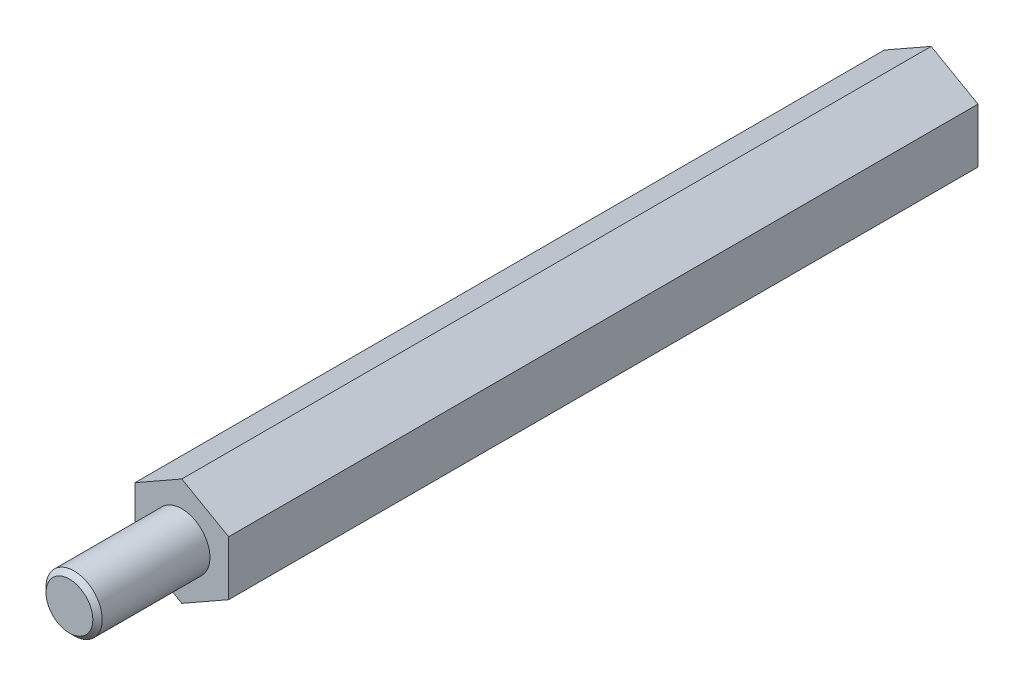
ISO-10303-21;
HEADER;
FILE_DESCRIPTION(('STEP AP214'),'2;1');
FILE_NAME('part.step','',(''),(''),'','','');
FILE_SCHEMA(('AUTOMOTIVE_DESIGN { 1 0 10303 214 1 1 1 1 }'));
ENDSEC;
DATA;
#1=APPLICATION_CONTEXT('core data for automotive mechanical design processes');
#2=APPLICATION_PROTOCOL_DEFINITION('international standard','automotive_design',2000,#1);
#3=PRODUCT_CONTEXT('',#1,'mechanical');
#4=PRODUCT('Part','Part','',(#3));
#5=PRODUCT_RELATED_PRODUCT_CATEGORY('part','',(#4));
#6=PRODUCT_DEFINITION_FORMATION('','',#4);
#7=PRODUCT_DEFINITION_CONTEXT('part definition',#1,'design');
#8=PRODUCT_DEFINITION('design','',#6,#7);
#9=PRODUCT_DEFINITION_SHAPE('','',#8);
#10=(LENGTH_UNIT() NAMED_UNIT(*) SI_UNIT(.MILLI.,.METRE.));
#11=(NAMED_UNIT(*) PLANE_ANGLE_UNIT() SI_UNIT($,.RADIAN.));
#12=(NAMED_UNIT(*) SI_UNIT($,.STERADIAN.) SOLID_ANGLE_UNIT());
#13=UNCERTAINTY_MEASURE_WITH_UNIT(LENGTH_MEASURE(1.E-05),#10,'distance_accuracy_value','');
#14=(GEOMETRIC_REPRESENTATION_CONTEXT(3) GLOBAL_UNCERTAINTY_ASSIGNED_CONTEXT((#13)) GLOBAL_UNIT_ASSIGNED_CONTEXT((#10,
#11,#12)) REPRESENTATION_CONTEXT('',''));
#15=CARTESIAN_POINT('',(0.,0.,0.));
#16=DIRECTION('',(0.,0.,1.));
#17=DIRECTION('',(1.,0.,0.));
#18=AXIS2_PLACEMENT_3D('',#15,#16,#17);
#19=CARTESIAN_POINT('',(-5.,8.58945417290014,80.));
#20=DIRECTION('',(0.,0.,-1.));
#21=DIRECTION('',(-1.,0.,0.));
#22=AXIS2_PLACEMENT_3D('',#19,#20,#21);
#23=PLANE('',#22);
#24=DIRECTION('',(-0.869565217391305,0.493818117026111,0.));
#25=VECTOR('',#24,1.);
#26=CARTESIAN_POINT('',(5.,2.91054582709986,80.));
#27=LINE('',#26,#25);
#28=CARTESIAN_POINT('',(5.,2.91054582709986,80.));
#29=VERTEX_POINT('',#28);
#30=CARTESIAN_POINT('',(0.,5.75,80.));
#31=VERTEX_POINT('',#30);
#32=EDGE_CURVE('E117',#29,#31,#27,.T.);
#33=ORIENTED_EDGE('',*,*,#32,.T.);
#34=DIRECTION('',(-0.869565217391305,-0.493818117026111,0.));
#35=VECTOR('',#34,1.);
#36=CARTESIAN_POINT('',(-5.,2.91054582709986,80.));
#37=LINE('',#36,#35);
#38=CARTESIAN_POINT('',(-5.,2.91054582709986,80.));
#39=VERTEX_POINT('',#38);
#40=EDGE_CURVE('E119',#31,#39,#37,.T.);
#41=ORIENTED_EDGE('',*,*,#40,.T.);
#42=DIRECTION('',(0.,-1.,0.));
#43=VECTOR('',#42,1.);
#44=CARTESIAN_POINT('',(-5.,-2.91054582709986,80.));
#45=LINE('',#44,#43);
#46=CARTESIAN_POINT('',(-5.,-2.91054582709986,80.));
#47=VERTEX_POINT('',#46);
#48=EDGE_CURVE('E121',#39,#47,#45,.T.);
#49=ORIENTED_EDGE('',*,*,#48,.T.);
#50=DIRECTION('',(0.869565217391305,-0.493818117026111,0.));
#51=VECTOR('',#50,1.);
#52=CARTESIAN_POINT('',(-5.,-2.91054582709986,80.));
#53=LINE('',#52,#51);
#54=CARTESIAN_POINT('',(0.,-5.75,80.));
#55=VERTEX_POINT('',#54);
#56=EDGE_CURVE('E123',#47,#55,#53,.T.);
#57=ORIENTED_EDGE('',*,*,#56,.T.);
#58=DIRECTION('',(0.869565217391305,0.493818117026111,0.));
#59=VECTOR('',#58,1.);
#60=CARTESIAN_POINT('',(5.,-2.91054582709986,80.));
#61=LINE('',#60,#59);
#62=CARTESIAN_POINT('',(5.,-2.91054582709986,80.));
#63=VERTEX_POINT('',#62);
#64=EDGE_CURVE('E52',#55,#63,#61,.T.);
#65=ORIENTED_EDGE('',*,*,#64,.T.);
#66=DIRECTION('',(0.,1.,0.));
#67=VECTOR('',#66,1.);
#68=CARTESIAN_POINT('',(5.,-2.91054582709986,80.));
#69=LINE('',#68,#67);
#70=EDGE_CURVE('E47',#63,#29,#69,.T.);
#71=ORIENTED_EDGE('',*,*,#70,.T.);
#72=EDGE_LOOP('',(#33,#41,#49,#57,#65,#71));
#73=FACE_BOUND('',#72,.T.);
#74=CARTESIAN_POINT('',(0.,0.,80.));
#75=DIRECTION('',(0.,0.,-1.));
#76=DIRECTION('',(-1.,0.,0.));
#77=AXIS2_PLACEMENT_3D('',#74,#75,#76);
#78=CIRCLE('',#77,3.);
#79=CARTESIAN_POINT('',(-3.,0.,80.));
#80=VERTEX_POINT('',#79);
#81=EDGE_CURVE('E145',#80,#80,#78,.F.);
#82=ORIENTED_EDGE('',*,*,#81,.F.);
#83=EDGE_LOOP('',(#82));
#84=FACE_BOUND('',#83,.T.);
#85=ADVANCED_FACE('F32',(#73,#84),#23,.F.);
#86=CARTESIAN_POINT('',(5.,2.91054582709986,80.));
#87=DIRECTION('',(-0.493818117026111,-0.869565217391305,0.));
#88=DIRECTION('',(0.869565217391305,-0.493818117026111,0.));
#89=AXIS2_PLACEMENT_3D('',#86,#87,#88);
#90=PLANE('',#89);
#91=DIRECTION('',(-0.869565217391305,0.493818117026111,0.));
#92=VECTOR('',#91,1.);
#93=CARTESIAN_POINT('',(5.,2.91054582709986,0.));
#94=LINE('',#93,#92);
#95=CARTESIAN_POINT('',(5.,2.91054582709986,0.));
#96=VERTEX_POINT('',#95);
#97=CARTESIAN_POINT('',(0.,5.75,0.));
#98=VERTEX_POINT('',#97);
#99=EDGE_CURVE('E104',#96,#98,#94,.T.);
#100=ORIENTED_EDGE('',*,*,#99,.T.);
#101=DIRECTION('',(0.,0.,-1.));
#102=VECTOR('',#101,1.);
#103=CARTESIAN_POINT('',(0.,5.75,80.));
#104=LINE('',#103,#102);
#105=EDGE_CURVE('E142',#31,#98,#104,.T.);
#106=ORIENTED_EDGE('',*,*,#105,.F.);
#107=ORIENTED_EDGE('',*,*,#32,.F.);
#108=DIRECTION('',(0.,0.,-1.));
#109=VECTOR('',#108,1.);
#110=CARTESIAN_POINT('',(5.,2.91054582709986,80.));
#111=LINE('',#110,#109);
#112=EDGE_CURVE('E127',#29,#96,#111,.T.);
#113=ORIENTED_EDGE('',*,*,#112,.T.);
#114=EDGE_LOOP('',(#100,#106,#107,#113));
#115=FACE_BOUND('',#114,.T.);
#116=ADVANCED_FACE('F34',(#115),#90,.F.);
#117=CARTESIAN_POINT('',(-5.,2.91054582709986,80.));
#118=DIRECTION('',(0.493818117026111,-0.869565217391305,0.));
#119=DIRECTION('',(0.869565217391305,0.493818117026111,0.));
#120=AXIS2_PLACEMENT_3D('',#117,#118,#119);
#121=PLANE('',#120);
#122=DIRECTION('',(-0.869565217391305,-0.493818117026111,0.));
#123=VECTOR('',#122,1.);
#124=CARTESIAN_POINT('',(-5.,2.91054582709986,0.));
#125=LINE('',#124,#123);
#126=CARTESIAN_POINT('',(-5.,2.91054582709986,0.));
#127=VERTEX_POINT('',#126);
#128=EDGE_CURVE('E107',#98,#127,#125,.T.);
#129=ORIENTED_EDGE('',*,*,#128,.T.);
#130=DIRECTION('',(0.,0.,-1.));
#131=VECTOR('',#130,1.);
#132=CARTESIAN_POINT('',(-5.,2.91054582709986,80.));
#133=LINE('',#132,#131);
#134=EDGE_CURVE('E139',#39,#127,#133,.T.);
#135=ORIENTED_EDGE('',*,*,#134,.F.);
#136=ORIENTED_EDGE('',*,*,#40,.F.);
#137=ORIENTED_EDGE('',*,*,#105,.T.);
#138=EDGE_LOOP('',(#129,#135,#136,#137));
#139=FACE_BOUND('',#138,.T.);
#140=ADVANCED_FACE('F166',(#139),#121,.F.);
#141=CARTESIAN_POINT('',(-5.,-2.91054582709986,80.));
#142=DIRECTION('',(1.,0.,0.));
#143=DIRECTION('',(0.,0.,-1.));
#144=AXIS2_PLACEMENT_3D('',#141,#142,#143);
#145=PLANE('',#144);
#146=DIRECTION('',(0.,-1.,0.));
#147=VECTOR('',#146,1.);
#148=CARTESIAN_POINT('',(-5.,-2.91054582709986,0.));
#149=LINE('',#148,#147);
#150=CARTESIAN_POINT('',(-5.,-2.91054582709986,0.));
#151=VERTEX_POINT('',#150);
#152=EDGE_CURVE('E109',#127,#151,#149,.T.);
#153=ORIENTED_EDGE('',*,*,#152,.T.);
#154=DIRECTION('',(0.,0.,-1.));
#155=VECTOR('',#154,1.);
#156=CARTESIAN_POINT('',(-5.,-2.91054582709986,80.));
#157=LINE('',#156,#155);
#158=EDGE_CURVE('E136',#47,#151,#157,.T.);
#159=ORIENTED_EDGE('',*,*,#158,.F.);
#160=ORIENTED_EDGE('',*,*,#48,.F.);
#161=ORIENTED_EDGE('',*,*,#134,.T.);
#162=EDGE_LOOP('',(#153,#159,#160,#161));
#163=FACE_BOUND('',#162,.T.);
#164=ADVANCED_FACE('F184',(#163),#145,.F.);
#165=CARTESIAN_POINT('',(-5.,-2.91054582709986,80.));
#166=DIRECTION('',(0.493818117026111,0.869565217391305,0.));
#167=DIRECTION('',(-0.869565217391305,0.493818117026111,0.));
#168=AXIS2_PLACEMENT_3D('',#165,#166,#167);
#169=PLANE('',#168);
#170=DIRECTION('',(0.869565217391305,-0.493818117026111,0.));
#171=VECTOR('',#170,1.);
#172=CARTESIAN_POINT('',(-5.,-2.91054582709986,0.));
#173=LINE('',#172,#171);
#174=CARTESIAN_POINT('',(0.,-5.75,0.));
#175=VERTEX_POINT('',#174);
#176=EDGE_CURVE('E111',#151,#175,#173,.T.);
#177=ORIENTED_EDGE('',*,*,#176,.T.);
#178=DIRECTION('',(0.,0.,-1.));
#179=VECTOR('',#178,1.);
#180=CARTESIAN_POINT('',(0.,-5.75,80.));
#181=LINE('',#180,#179);
#182=EDGE_CURVE('E133',#55,#175,#181,.T.);
#183=ORIENTED_EDGE('',*,*,#182,.F.);
#184=ORIENTED_EDGE('',*,*,#56,.F.);
#185=ORIENTED_EDGE('',*,*,#158,.T.);
#186=EDGE_LOOP('',(#177,#183,#184,#185));
#187=FACE_BOUND('',#186,.T.);
#188=ADVANCED_FACE('F180',(#187),#169,.F.);
#189=CARTESIAN_POINT('',(5.,-2.91054582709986,80.));
#190=DIRECTION('',(-0.493818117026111,0.869565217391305,0.));
#191=DIRECTION('',(-0.869565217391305,-0.493818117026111,0.));
#192=AXIS2_PLACEMENT_3D('',#189,#190,#191);
#193=PLANE('',#192);
#194=DIRECTION('',(0.869565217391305,0.493818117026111,0.));
#195=VECTOR('',#194,1.);
#196=CARTESIAN_POINT('',(5.,-2.91054582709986,0.));
#197=LINE('',#196,#195);
#198=CARTESIAN_POINT('',(5.,-2.91054582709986,0.));
#199=VERTEX_POINT('',#198);
#200=EDGE_CURVE('E113',#175,#199,#197,.T.);
#201=ORIENTED_EDGE('',*,*,#200,.T.);
#202=DIRECTION('',(0.,0.,-1.));
#203=VECTOR('',#202,1.);
#204=CARTESIAN_POINT('',(5.,-2.91054582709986,80.));
#205=LINE('',#204,#203);
#206=EDGE_CURVE('E130',#63,#199,#205,.T.);
#207=ORIENTED_EDGE('',*,*,#206,.F.);
#208=ORIENTED_EDGE('',*,*,#64,.F.);
#209=ORIENTED_EDGE('',*,*,#182,.T.);
#210=EDGE_LOOP('',(#201,#207,#208,#209));
#211=FACE_BOUND('',#210,.T.);
#212=ADVANCED_FACE('F176',(#211),#193,.F.);
#213=CARTESIAN_POINT('',(5.,-2.91054582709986,80.));
#214=DIRECTION('',(-1.,0.,0.));
#215=DIRECTION('',(0.,0.,1.));
#216=AXIS2_PLACEMENT_3D('',#213,#214,#215);
#217=PLANE('',#216);
#218=DIRECTION('',(0.,1.,0.));
#219=VECTOR('',#218,1.);
#220=CARTESIAN_POINT('',(5.,-2.91054582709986,0.));
#221=LINE('',#220,#219);
#222=EDGE_CURVE('E115',#199,#96,#221,.T.);
#223=ORIENTED_EDGE('',*,*,#222,.T.);
#224=ORIENTED_EDGE('',*,*,#112,.F.);
#225=ORIENTED_EDGE('',*,*,#70,.F.);
#226=ORIENTED_EDGE('',*,*,#206,.T.);
#227=EDGE_LOOP('',(#223,#224,#225,#226));
#228=FACE_BOUND('',#227,.T.);
#229=ADVANCED_FACE('F173',(#228),#217,.F.);
#230=CARTESIAN_POINT('',(-5.,8.58945417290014,0.));
#231=DIRECTION('',(0.,0.,-1.));
#232=DIRECTION('',(-1.,0.,0.));
#233=AXIS2_PLACEMENT_3D('',#230,#231,#232);
#234=PLANE('',#233);
#235=CARTESIAN_POINT('',(0.,0.,0.));
#236=DIRECTION('',(0.,0.,-1.));
#237=DIRECTION('',(-1.,0.,0.));
#238=AXIS2_PLACEMENT_3D('',#235,#236,#237);
#239=CIRCLE('',#238,3.5);
#240=CARTESIAN_POINT('',(-3.5,0.,0.));
#241=VERTEX_POINT('',#240);
#242=EDGE_CURVE('E99',#241,#241,#239,.T.);
#243=ORIENTED_EDGE('',*,*,#242,.F.);
#244=EDGE_LOOP('',(#243));
#245=FACE_BOUND('',#244,.T.);
#246=ORIENTED_EDGE('',*,*,#99,.F.);
#247=ORIENTED_EDGE('',*,*,#222,.F.);
#248=ORIENTED_EDGE('',*,*,#200,.F.);
#249=ORIENTED_EDGE('',*,*,#176,.F.);
#250=ORIENTED_EDGE('',*,*,#152,.F.);
#251=ORIENTED_EDGE('',*,*,#128,.F.);
#252=EDGE_LOOP('',(#246,#247,#248,#249,#250,#251));
#253=FACE_BOUND('',#252,.T.);
#254=ADVANCED_FACE('F171',(#245,#253),#234,.T.);
#255=CARTESIAN_POINT('',(0.,0.,0.));
#256=DIRECTION('',(0.,0.,-1.));
#257=DIRECTION('',(-1.,0.,0.));
#258=AXIS2_PLACEMENT_3D('',#255,#256,#257);
#259=CONICAL_SURFACE('',#258,3.5,0.785398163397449);
#260=CARTESIAN_POINT('',(0.,0.,1.));
#261=DIRECTION('',(0.,0.,-1.));
#262=DIRECTION('',(-1.,0.,0.));
#263=AXIS2_PLACEMENT_3D('',#260,#261,#262);
#264=CIRCLE('',#263,2.5);
#265=CARTESIAN_POINT('',(-2.5,0.,1.));
#266=VERTEX_POINT('',#265);
#267=EDGE_CURVE('E96',#266,#266,#264,.T.);
#268=ORIENTED_EDGE('',*,*,#267,.F.);
#269=EDGE_LOOP('',(#268));
#270=FACE_BOUND('',#269,.T.);
#271=ORIENTED_EDGE('',*,*,#242,.T.);
#272=EDGE_LOOP('',(#271));
#273=FACE_BOUND('',#272,.T.);
#274=ADVANCED_FACE('F206',(#270,#273),#259,.F.);
#275=CARTESIAN_POINT('',(0.,0.,0.));
#276=DIRECTION('',(0.,0.,-1.));
#277=DIRECTION('',(-1.,0.,0.));
#278=AXIS2_PLACEMENT_3D('',#275,#276,#277);
#279=CYLINDRICAL_SURFACE('',#278,2.5);
#280=CARTESIAN_POINT('',(0.,0.,17.));
#281=DIRECTION('',(0.,0.,-1.));
#282=DIRECTION('',(-1.,0.,0.));
#283=AXIS2_PLACEMENT_3D('',#280,#281,#282);
#284=CIRCLE('',#283,2.5);
#285=CARTESIAN_POINT('',(-2.5,0.,17.));
#286=VERTEX_POINT('',#285);
#287=EDGE_CURVE('E94',#286,#286,#284,.T.);
#288=ORIENTED_EDGE('',*,*,#287,.F.);
#289=EDGE_LOOP('',(#288));
#290=FACE_BOUND('',#289,.T.);
#291=ORIENTED_EDGE('',*,*,#267,.T.);
#292=EDGE_LOOP('',(#291));
#293=FACE_BOUND('',#292,.T.);
#294=ADVANCED_FACE('F90',(#290,#293),#279,.F.);
#295=CARTESIAN_POINT('',(0.,0.,17.));
#296=DIRECTION('',(0.,0.,-1.));
#297=DIRECTION('',(-1.,0.,0.));
#298=AXIS2_PLACEMENT_3D('',#295,#296,#297);
#299=CONICAL_SURFACE('',#298,2.5,1.02974425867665);
#300=CARTESIAN_POINT('',(0.,0.,18.5021515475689));
#301=VERTEX_POINT('',#300);
#302=VERTEX_LOOP('',#301);
#303=FACE_BOUND('',#302,.T.);
#304=ORIENTED_EDGE('',*,*,#287,.T.);
#305=EDGE_LOOP('',(#304));
#306=FACE_BOUND('',#305,.T.);
#307=ADVANCED_FACE('F86',(#303,#306),#299,.F.);
#308=CARTESIAN_POINT('',(0.,0.,92.));
#309=DIRECTION('',(0.,0.,-1.));
#310=DIRECTION('',(-1.,0.,0.));
#311=AXIS2_PLACEMENT_3D('',#308,#309,#310);
#312=CYLINDRICAL_SURFACE('',#311,3.);
#313=CARTESIAN_POINT('',(0.,0.,91.5));
#314=DIRECTION('',(0.,0.,1.));
#315=DIRECTION('',(1.,0.,0.));
#316=AXIS2_PLACEMENT_3D('',#313,#314,#315);
#317=CIRCLE('',#316,3.);
#318=CARTESIAN_POINT('',(3.,0.,91.5));
#319=VERTEX_POINT('',#318);
#320=EDGE_CURVE('E11',#319,#319,#317,.F.);
#321=ORIENTED_EDGE('',*,*,#320,.T.);
#322=EDGE_LOOP('',(#321));
#323=FACE_BOUND('',#322,.T.);
#324=ORIENTED_EDGE('',*,*,#81,.T.);
#325=EDGE_LOOP('',(#324));
#326=FACE_BOUND('',#325,.T.);
#327=ADVANCED_FACE('F89',(#323,#326),#312,.T.);
#328=CARTESIAN_POINT('',(0.,0.,92.));
#329=DIRECTION('',(0.,0.,1.));
#330=DIRECTION('',(1.,0.,0.));
#331=AXIS2_PLACEMENT_3D('',#328,#329,#330);
#332=PLANE('',#331);
#333=CARTESIAN_POINT('',(0.,0.,92.));
#334=DIRECTION('',(0.,0.,1.));
#335=DIRECTION('',(1.,0.,0.));
#336=AXIS2_PLACEMENT_3D('',#333,#334,#335);
#337=CIRCLE('',#336,2.50000000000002);
#338=CARTESIAN_POINT('',(2.50000000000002,0.,92.));
#339=VERTEX_POINT('',#338);
#340=EDGE_CURVE('E40',#339,#339,#337,.T.);
#341=ORIENTED_EDGE('',*,*,#340,.T.);
#342=EDGE_LOOP('',(#341));
#343=FACE_BOUND('',#342,.T.);
#344=ADVANCED_FACE('F150',(#343),#332,.T.);
#345=CARTESIAN_POINT('',(0.,0.,92.));
#346=DIRECTION('',(0.,0.,-1.));
#347=DIRECTION('',(-1.,0.,0.));
#348=AXIS2_PLACEMENT_3D('',#345,#346,#347);
#349=CONICAL_SURFACE('',#348,2.50000000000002,0.785398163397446);
#350=ORIENTED_EDGE('',*,*,#320,.F.);
#351=EDGE_LOOP('',(#350));
#352=FACE_BOUND('',#351,.T.);
#353=ORIENTED_EDGE('',*,*,#340,.F.);
#354=EDGE_LOOP('',(#353));
#355=FACE_BOUND('',#354,.T.);
#356=ADVANCED_FACE('F152',(#352,#355),#349,.T.);
#357=CLOSED_SHELL('',(#85,#116,#140,#164,#188,#212,#229,#254,#274,#294,#307,#327,#344,#356));
#358=MANIFOLD_SOLID_BREP('B2',#357);
#359=ADVANCED_BREP_SHAPE_REPRESENTATION('',(#18,#358),#14);
#360=SHAPE_DEFINITION_REPRESENTATION(#9,#359);
ENDSEC;
END-ISO-10303-21;
